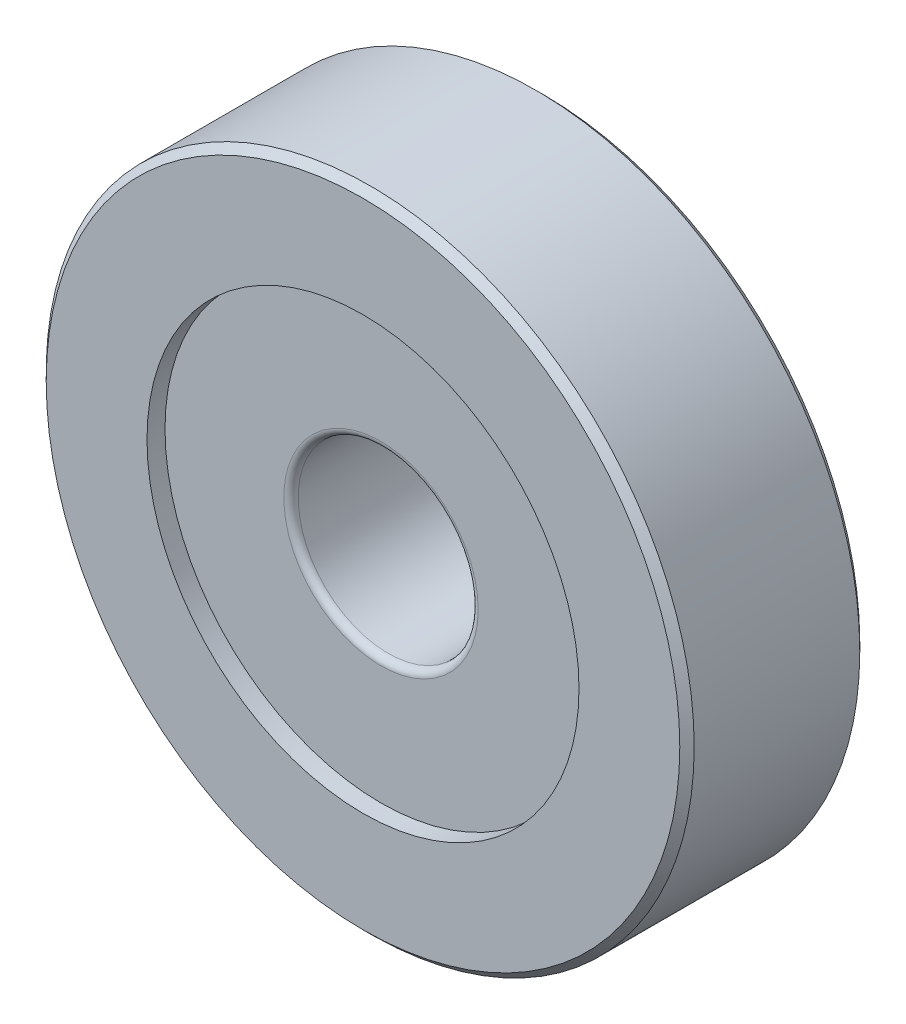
ISO-10303-21;
HEADER;
FILE_DESCRIPTION(('STEP AP214'),'2;1');
FILE_NAME('part.step','',(''),(''),'','','');
FILE_SCHEMA(('AUTOMOTIVE_DESIGN { 1 0 10303 214 1 1 1 1 }'));
ENDSEC;
DATA;
#1=APPLICATION_CONTEXT('core data for automotive mechanical design processes');
#2=APPLICATION_PROTOCOL_DEFINITION('international standard','automotive_design',2000,#1);
#3=PRODUCT_CONTEXT('',#1,'mechanical');
#4=PRODUCT('Part','Part','',(#3));
#5=PRODUCT_RELATED_PRODUCT_CATEGORY('part','',(#4));
#6=PRODUCT_DEFINITION_FORMATION('','',#4);
#7=PRODUCT_DEFINITION_CONTEXT('part definition',#1,'design');
#8=PRODUCT_DEFINITION('design','',#6,#7);
#9=PRODUCT_DEFINITION_SHAPE('','',#8);
#10=(LENGTH_UNIT() NAMED_UNIT(*) SI_UNIT(.MILLI.,.METRE.));
#11=(NAMED_UNIT(*) PLANE_ANGLE_UNIT() SI_UNIT($,.RADIAN.));
#12=(NAMED_UNIT(*) SI_UNIT($,.STERADIAN.) SOLID_ANGLE_UNIT());
#13=UNCERTAINTY_MEASURE_WITH_UNIT(LENGTH_MEASURE(1.E-05),#10,'distance_accuracy_value','');
#14=(GEOMETRIC_REPRESENTATION_CONTEXT(3) GLOBAL_UNCERTAINTY_ASSIGNED_CONTEXT((#13)) GLOBAL_UNIT_ASSIGNED_CONTEXT((#10,
#11,#12)) REPRESENTATION_CONTEXT('',''));
#15=CARTESIAN_POINT('',(0.,0.,0.));
#16=DIRECTION('',(0.,0.,1.));
#17=DIRECTION('',(1.,0.,0.));
#18=AXIS2_PLACEMENT_3D('',#15,#16,#17);
#19=CARTESIAN_POINT('',(0.,0.,1.8));
#20=DIRECTION('',(0.,0.,1.));
#21=DIRECTION('',(1.,0.,0.));
#22=AXIS2_PLACEMENT_3D('',#19,#20,#21);
#23=TOROIDAL_SURFACE('',#22,2.7,0.200000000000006);
#24=CARTESIAN_POINT('',(0.,0.,1.8));
#25=DIRECTION('',(0.,0.,1.));
#26=DIRECTION('',(1.,0.,0.));
#27=AXIS2_PLACEMENT_3D('',#24,#25,#26);
#28=CIRCLE('',#27,2.5);
#29=CARTESIAN_POINT('',(2.5,0.,1.8));
#30=VERTEX_POINT('',#29);
#31=EDGE_CURVE('E8',#30,#30,#28,.T.);
#32=ORIENTED_EDGE('',*,*,#31,.F.);
#33=EDGE_LOOP('',(#32));
#34=FACE_BOUND('',#33,.T.);
#35=CARTESIAN_POINT('',(0.,0.,2.));
#36=DIRECTION('',(0.,0.,1.));
#37=DIRECTION('',(1.,0.,0.));
#38=AXIS2_PLACEMENT_3D('',#35,#36,#37);
#39=CIRCLE('',#38,2.7);
#40=CARTESIAN_POINT('',(2.7,0.,2.));
#41=VERTEX_POINT('',#40);
#42=EDGE_CURVE('E52',#41,#41,#39,.T.);
#43=ORIENTED_EDGE('',*,*,#42,.T.);
#44=EDGE_LOOP('',(#43));
#45=FACE_BOUND('',#44,.T.);
#46=ADVANCED_FACE('F12',(#34,#45),#23,.T.);
#47=CARTESIAN_POINT('',(0.,0.,5.5));
#48=DIRECTION('',(0.,0.,1.));
#49=DIRECTION('',(1.,0.,0.));
#50=AXIS2_PLACEMENT_3D('',#47,#48,#49);
#51=CYLINDRICAL_SURFACE('',#50,2.5);
#52=CARTESIAN_POINT('',(0.,0.,-1.8));
#53=DIRECTION('',(0.,0.,1.));
#54=DIRECTION('',(1.,0.,0.));
#55=AXIS2_PLACEMENT_3D('',#52,#53,#54);
#56=CIRCLE('',#55,2.5);
#57=CARTESIAN_POINT('',(2.5,0.,-1.8));
#58=VERTEX_POINT('',#57);
#59=EDGE_CURVE('E18',#58,#58,#56,.T.);
#60=ORIENTED_EDGE('',*,*,#59,.F.);
#61=EDGE_LOOP('',(#60));
#62=FACE_BOUND('',#61,.T.);
#63=ORIENTED_EDGE('',*,*,#31,.T.);
#64=EDGE_LOOP('',(#63));
#65=FACE_BOUND('',#64,.T.);
#66=ADVANCED_FACE('F113',(#62,#65),#51,.F.);
#67=CARTESIAN_POINT('',(0.,0.,-1.8));
#68=DIRECTION('',(0.,0.,1.));
#69=DIRECTION('',(1.,0.,0.));
#70=AXIS2_PLACEMENT_3D('',#67,#68,#69);
#71=TOROIDAL_SURFACE('',#70,2.7,0.200000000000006);
#72=CARTESIAN_POINT('',(0.,0.,-2.));
#73=DIRECTION('',(0.,0.,1.));
#74=DIRECTION('',(1.,0.,0.));
#75=AXIS2_PLACEMENT_3D('',#72,#73,#74);
#76=CIRCLE('',#75,2.7);
#77=CARTESIAN_POINT('',(2.7,0.,-2.));
#78=VERTEX_POINT('',#77);
#79=EDGE_CURVE('E22',#78,#78,#76,.T.);
#80=ORIENTED_EDGE('',*,*,#79,.F.);
#81=EDGE_LOOP('',(#80));
#82=FACE_BOUND('',#81,.T.);
#83=ORIENTED_EDGE('',*,*,#59,.T.);
#84=EDGE_LOOP('',(#83));
#85=FACE_BOUND('',#84,.T.);
#86=ADVANCED_FACE('F108',(#82,#85),#71,.T.);
#87=CARTESIAN_POINT('',(0.,2.7,-2.));
#88=DIRECTION('',(0.,0.,1.));
#89=DIRECTION('',(1.,0.,0.));
#90=AXIS2_PLACEMENT_3D('',#87,#88,#89);
#91=PLANE('',#90);
#92=CARTESIAN_POINT('',(0.,0.,-2.));
#93=DIRECTION('',(0.,0.,1.));
#94=DIRECTION('',(1.,0.,0.));
#95=AXIS2_PLACEMENT_3D('',#92,#93,#94);
#96=CIRCLE('',#95,6.);
#97=CARTESIAN_POINT('',(6.,0.,-2.));
#98=VERTEX_POINT('',#97);
#99=EDGE_CURVE('E26',#98,#98,#96,.T.);
#100=ORIENTED_EDGE('',*,*,#99,.F.);
#101=EDGE_LOOP('',(#100));
#102=FACE_BOUND('',#101,.T.);
#103=ORIENTED_EDGE('',*,*,#79,.T.);
#104=EDGE_LOOP('',(#103));
#105=FACE_BOUND('',#104,.T.);
#106=ADVANCED_FACE('F102',(#102,#105),#91,.F.);
#107=CARTESIAN_POINT('',(0.,0.,5.5));
#108=DIRECTION('',(0.,0.,1.));
#109=DIRECTION('',(1.,0.,0.));
#110=AXIS2_PLACEMENT_3D('',#107,#108,#109);
#111=CYLINDRICAL_SURFACE('',#110,6.);
#112=CARTESIAN_POINT('',(0.,0.,-2.5));
#113=DIRECTION('',(0.,0.,1.));
#114=DIRECTION('',(1.,0.,0.));
#115=AXIS2_PLACEMENT_3D('',#112,#113,#114);
#116=CIRCLE('',#115,6.);
#117=CARTESIAN_POINT('',(6.,0.,-2.5));
#118=VERTEX_POINT('',#117);
#119=EDGE_CURVE('E31',#118,#118,#116,.T.);
#120=ORIENTED_EDGE('',*,*,#119,.F.);
#121=EDGE_LOOP('',(#120));
#122=FACE_BOUND('',#121,.T.);
#123=ORIENTED_EDGE('',*,*,#99,.T.);
#124=EDGE_LOOP('',(#123));
#125=FACE_BOUND('',#124,.T.);
#126=ADVANCED_FACE('F96',(#122,#125),#111,.F.);
#127=CARTESIAN_POINT('',(0.,8.8,-2.5));
#128=DIRECTION('',(0.,0.,1.));
#129=DIRECTION('',(1.,0.,0.));
#130=AXIS2_PLACEMENT_3D('',#127,#128,#129);
#131=PLANE('',#130);
#132=CARTESIAN_POINT('',(0.,0.,-2.5));
#133=DIRECTION('',(0.,0.,1.));
#134=DIRECTION('',(1.,0.,0.));
#135=AXIS2_PLACEMENT_3D('',#132,#133,#134);
#136=CIRCLE('',#135,8.8);
#137=CARTESIAN_POINT('',(8.8,0.,-2.5));
#138=VERTEX_POINT('',#137);
#139=EDGE_CURVE('E34',#138,#138,#136,.T.);
#140=ORIENTED_EDGE('',*,*,#139,.F.);
#141=EDGE_LOOP('',(#140));
#142=FACE_BOUND('',#141,.T.);
#143=ORIENTED_EDGE('',*,*,#119,.T.);
#144=EDGE_LOOP('',(#143));
#145=FACE_BOUND('',#144,.T.);
#146=ADVANCED_FACE('F90',(#142,#145),#131,.F.);
#147=CARTESIAN_POINT('',(0.,0.,-2.5));
#148=DIRECTION('',(0.,0.,1.));
#149=DIRECTION('',(1.,0.,0.));
#150=AXIS2_PLACEMENT_3D('',#147,#148,#149);
#151=CONICAL_SURFACE('',#150,8.8,0.785398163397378);
#152=CARTESIAN_POINT('',(0.,0.,-2.3));
#153=DIRECTION('',(0.,0.,1.));
#154=DIRECTION('',(1.,0.,0.));
#155=AXIS2_PLACEMENT_3D('',#152,#153,#154);
#156=CIRCLE('',#155,9.);
#157=CARTESIAN_POINT('',(9.,0.,-2.3));
#158=VERTEX_POINT('',#157);
#159=EDGE_CURVE('E37',#158,#158,#156,.T.);
#160=ORIENTED_EDGE('',*,*,#159,.F.);
#161=EDGE_LOOP('',(#160));
#162=FACE_BOUND('',#161,.T.);
#163=ORIENTED_EDGE('',*,*,#139,.T.);
#164=EDGE_LOOP('',(#163));
#165=FACE_BOUND('',#164,.T.);
#166=ADVANCED_FACE('F84',(#162,#165),#151,.T.);
#167=CARTESIAN_POINT('',(0.,0.,5.5));
#168=DIRECTION('',(0.,0.,1.));
#169=DIRECTION('',(1.,0.,0.));
#170=AXIS2_PLACEMENT_3D('',#167,#168,#169);
#171=CYLINDRICAL_SURFACE('',#170,9.);
#172=CARTESIAN_POINT('',(0.,0.,2.3));
#173=DIRECTION('',(0.,0.,1.));
#174=DIRECTION('',(1.,0.,0.));
#175=AXIS2_PLACEMENT_3D('',#172,#173,#174);
#176=CIRCLE('',#175,9.);
#177=CARTESIAN_POINT('',(9.,0.,2.3));
#178=VERTEX_POINT('',#177);
#179=EDGE_CURVE('E40',#178,#178,#176,.T.);
#180=ORIENTED_EDGE('',*,*,#179,.F.);
#181=EDGE_LOOP('',(#180));
#182=FACE_BOUND('',#181,.T.);
#183=ORIENTED_EDGE('',*,*,#159,.T.);
#184=EDGE_LOOP('',(#183));
#185=FACE_BOUND('',#184,.T.);
#186=ADVANCED_FACE('F78',(#182,#185),#171,.T.);
#187=CARTESIAN_POINT('',(0.,0.,2.3));
#188=DIRECTION('',(0.,0.,-1.));
#189=DIRECTION('',(-1.,0.,0.));
#190=AXIS2_PLACEMENT_3D('',#187,#188,#189);
#191=CONICAL_SURFACE('',#190,9.,0.785398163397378);
#192=CARTESIAN_POINT('',(0.,0.,2.5));
#193=DIRECTION('',(0.,0.,1.));
#194=DIRECTION('',(1.,0.,0.));
#195=AXIS2_PLACEMENT_3D('',#192,#193,#194);
#196=CIRCLE('',#195,8.8);
#197=CARTESIAN_POINT('',(8.8,0.,2.5));
#198=VERTEX_POINT('',#197);
#199=EDGE_CURVE('E43',#198,#198,#196,.T.);
#200=ORIENTED_EDGE('',*,*,#199,.F.);
#201=EDGE_LOOP('',(#200));
#202=FACE_BOUND('',#201,.T.);
#203=ORIENTED_EDGE('',*,*,#179,.T.);
#204=EDGE_LOOP('',(#203));
#205=FACE_BOUND('',#204,.T.);
#206=ADVANCED_FACE('F72',(#202,#205),#191,.T.);
#207=CARTESIAN_POINT('',(0.,8.8,2.5));
#208=DIRECTION('',(0.,0.,-1.));
#209=DIRECTION('',(-1.,0.,0.));
#210=AXIS2_PLACEMENT_3D('',#207,#208,#209);
#211=PLANE('',#210);
#212=CARTESIAN_POINT('',(0.,0.,2.5));
#213=DIRECTION('',(0.,0.,1.));
#214=DIRECTION('',(1.,0.,0.));
#215=AXIS2_PLACEMENT_3D('',#212,#213,#214);
#216=CIRCLE('',#215,6.);
#217=CARTESIAN_POINT('',(6.,0.,2.5));
#218=VERTEX_POINT('',#217);
#219=EDGE_CURVE('E46',#218,#218,#216,.T.);
#220=ORIENTED_EDGE('',*,*,#219,.F.);
#221=EDGE_LOOP('',(#220));
#222=FACE_BOUND('',#221,.T.);
#223=ORIENTED_EDGE('',*,*,#199,.T.);
#224=EDGE_LOOP('',(#223));
#225=FACE_BOUND('',#224,.T.);
#226=ADVANCED_FACE('F66',(#222,#225),#211,.F.);
#227=CARTESIAN_POINT('',(0.,0.,5.5));
#228=DIRECTION('',(0.,0.,1.));
#229=DIRECTION('',(1.,0.,0.));
#230=AXIS2_PLACEMENT_3D('',#227,#228,#229);
#231=CYLINDRICAL_SURFACE('',#230,6.);
#232=CARTESIAN_POINT('',(0.,0.,2.));
#233=DIRECTION('',(0.,0.,1.));
#234=DIRECTION('',(1.,0.,0.));
#235=AXIS2_PLACEMENT_3D('',#232,#233,#234);
#236=CIRCLE('',#235,6.);
#237=CARTESIAN_POINT('',(6.,0.,2.));
#238=VERTEX_POINT('',#237);
#239=EDGE_CURVE('E49',#238,#238,#236,.T.);
#240=ORIENTED_EDGE('',*,*,#239,.F.);
#241=EDGE_LOOP('',(#240));
#242=FACE_BOUND('',#241,.T.);
#243=ORIENTED_EDGE('',*,*,#219,.T.);
#244=EDGE_LOOP('',(#243));
#245=FACE_BOUND('',#244,.T.);
#246=ADVANCED_FACE('F60',(#242,#245),#231,.F.);
#247=CARTESIAN_POINT('',(0.,6.,2.));
#248=DIRECTION('',(0.,0.,-1.));
#249=DIRECTION('',(-1.,0.,0.));
#250=AXIS2_PLACEMENT_3D('',#247,#248,#249);
#251=PLANE('',#250);
#252=ORIENTED_EDGE('',*,*,#42,.F.);
#253=EDGE_LOOP('',(#252));
#254=FACE_BOUND('',#253,.T.);
#255=ORIENTED_EDGE('',*,*,#239,.T.);
#256=EDGE_LOOP('',(#255));
#257=FACE_BOUND('',#256,.T.);
#258=ADVANCED_FACE('F57',(#254,#257),#251,.F.);
#259=CLOSED_SHELL('',(#46,#66,#86,#106,#126,#146,#166,#186,#206,#226,#246,#258));
#260=MANIFOLD_SOLID_BREP('B1',#259);
#261=ADVANCED_BREP_SHAPE_REPRESENTATION('',(#18,#260),#14);
#262=SHAPE_DEFINITION_REPRESENTATION(#9,#261);
ENDSEC;
END-ISO-10303-21;
